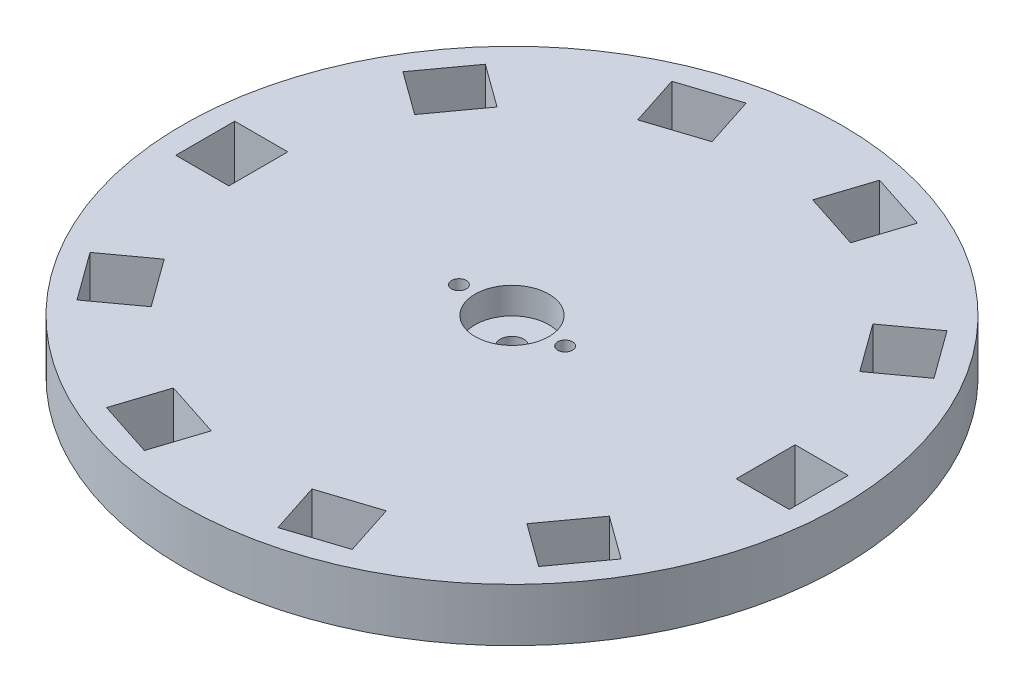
from build123d import *

# Parameters (mm, degrees)
SKETCH1_R               = 111.73
BOSS_EXTRUDE1_DEPTH     = 18
CUT_EXTRUDE1_DEPTH      = 160.032027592
CUT_EXTRUDE1_DEPTH_BACK = 160.032027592
SKETCH2_R               = 4
SKETCH3_R               = 12.5
CUT_EXTRUDE2_DEPTH      = 9
SKETCH4_R               = 2.5
CUT_EXTRUDE3_DEPTH      = 160.032027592
SKETCH5_W               = 18
SKETCH5_H               = 20
CUT_EXTRUDE4_DEPTH      = 160.032027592


with BuildPart() as part:
    # Sketch1 → Boss-Extrude1 (new body)
    with BuildSketch(Plane(origin=(0, 0, 0), x_dir=(1, 0, 0), z_dir=(0, 1, 0))):
        with Locations(Location((0, 0, 0), (0, 0, 270))):
            Circle(SKETCH1_R)
    extrude(amount=BOSS_EXTRUDE1_DEPTH)

    # Sketch2 → Cut-Extrude1 (cut, two sides: drawn at the far end of the back side and taken through both)
    with BuildSketch(Plane(origin=(0, 18, 0), x_dir=(1, 0, 0), z_dir=(0, 1, 0)).offset(-CUT_EXTRUDE1_DEPTH_BACK)):
        with Locations(Location((0, 0, 0), (0, 0, 270))):
            Circle(SKETCH2_R)
    extrude(amount=CUT_EXTRUDE1_DEPTH + CUT_EXTRUDE1_DEPTH_BACK, mode=Mode.SUBTRACT)

    # Sketch3 → Cut-Extrude2 (cut)
    with BuildSketch(Plane(origin=(0, 18, 0), x_dir=(1, 0, 0), z_dir=(0, 1, 0))):
        with Locations(Location((0, 0, 0), (0, 0, 270))):
            Circle(SKETCH3_R)
    extrude(amount=-CUT_EXTRUDE2_DEPTH, mode=Mode.SUBTRACT)

    # Sketch4 → Cut-Extrude3 (cut, through all)
    with BuildSketch(Plane(origin=(0, 18, 0), x_dir=(1, 0, 0), z_dir=(0, 1, 0))):
        with Locations(Location((18, 0, 0), (0, 0, 270))):
            Circle(SKETCH4_R)
        with Locations(Location((-18, 0, 0), (0, 0, 90))):
            Circle(SKETCH4_R)
    extrude(amount=-CUT_EXTRUDE3_DEPTH, mode=Mode.SUBTRACT)

    # Sketch5 → Cut-Extrude4 (cut, through all)
    with BuildSketch(Plane.XZ):
        Polygon((90.015619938, -53.039496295), (75.453314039, -42.459361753), (63.697608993, -58.639701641), (78.259914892, -69.219836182), align=None)
        with Locations((95, 0)):
            Rectangle(SKETCH5_W, SKETCH5_H)
        Polygon((41.648332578, -95.819707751), (36.086026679, -78.700690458), (17.064896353, -84.881030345), (22.627202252, -102.000047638), align=None)
        Polygon((-22.627202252, -102.000047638), (-17.064896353, -84.881030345), (-36.086026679, -78.700690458), (-41.648332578, -95.819707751), align=None)
        Polygon((-78.259914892, -69.219836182), (-63.697608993, -58.639701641), (-75.453314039, -42.459361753), (-90.015619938, -53.039496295), align=None)
        with Locations((-95, 0)):
            Rectangle(SKETCH5_W, SKETCH5_H)
        Polygon((-90.015619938, 53.039496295), (-75.453314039, 42.459361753), (-63.697608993, 58.639701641), (-78.259914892, 69.219836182), align=None)
        Polygon((-41.648332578, 95.819707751), (-36.086026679, 78.700690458), (-17.064896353, 84.881030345), (-22.627202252, 102.000047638), align=None)
        Polygon((22.627202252, 102.000047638), (17.064896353, 84.881030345), (36.086026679, 78.700690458), (41.648332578, 95.819707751), align=None)
        Polygon((78.259914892, 69.219836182), (63.697608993, 58.639701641), (75.453314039, 42.459361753), (90.015619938, 53.039496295), align=None)
    extrude(amount=-CUT_EXTRUDE4_DEPTH, mode=Mode.SUBTRACT)


solid = part.part
